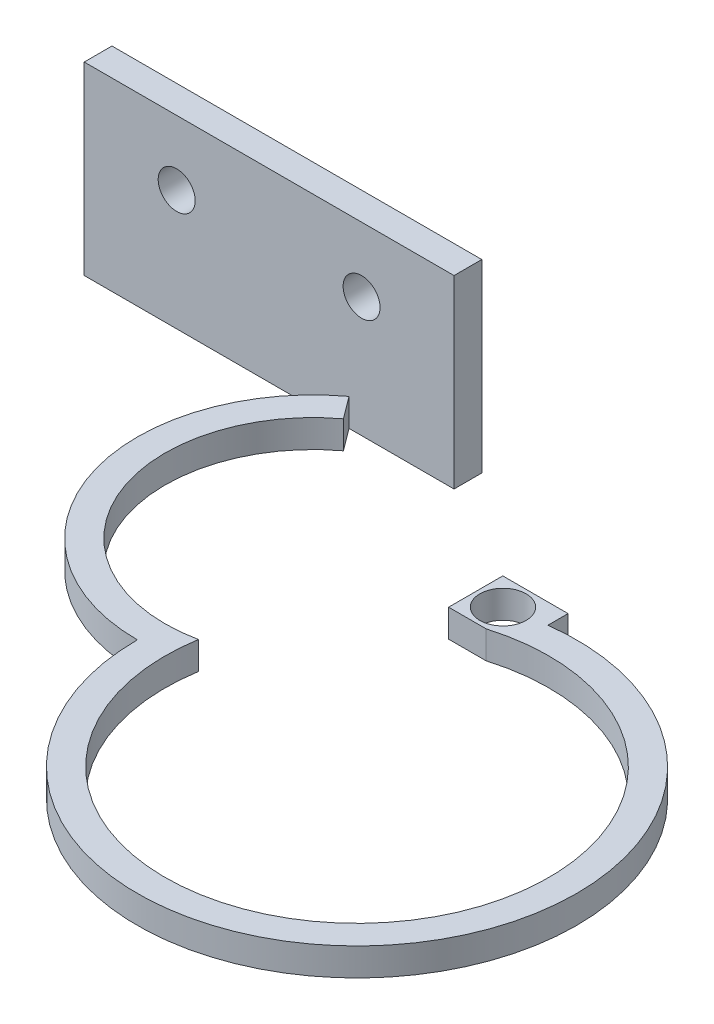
from build123d import *

# Parameters (mm, degrees)
SKIZZE1_W                       = 40
SKIZZE1_H                       = 20
SKIZZE1_R                       = 2
AUFSATZ_LINEAR_AUSTRAGEN1_DEPTH = 3
SKIZZE2_R                       = 2.5
AUFSATZ_LINEAR_AUSTRAGEN2_DEPTH = 3


with BuildPart() as part:
    # Skizze1 → Aufsatz-Linear austragen1 (new body)
    with BuildSketch(Plane.XY):
        with Locations((20, 10)):
            Rectangle(SKIZZE1_W, SKIZZE1_H)
        with Locations((10, 13)):
            Circle(SKIZZE1_R, mode=Mode.SUBTRACT)
        with Locations((30, 13)):
            Circle(SKIZZE1_R, mode=Mode.SUBTRACT)
    extrude(amount=AUFSATZ_LINEAR_AUSTRAGEN1_DEPTH)


with BuildPart() as body_2:
    # Skizze2 → Aufsatz-Linear austragen2 (new body)
    with BuildSketch(Plane.XZ):
        with BuildLine():
            Line((60.832427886, 13.676562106), (60.832427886, 11.5))
            Line((60.832427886, 11.5), (53.771624, 11.5))
            Line((53.771624, 11.5), (53.771624, 17.359476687))
            Line((53.771624, 17.359476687), (57.832427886, 17.359476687))
            ThreePointArc((57.832427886, 17.359476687), (79.344926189, 50.963088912), (43.27006525, 33.916249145))
            ThreePointArc((43.27006525, 33.916249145), (25.401600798, 24.815915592), (30.436247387, 5.405855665))
            Line((30.436247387, 5.405855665), (28.644081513, 3))
            ThreePointArc((28.644081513, 3), (21.956452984, 24.226367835), (40, 37.25378039))
            ThreePointArc((40, 37.25378039), (81.561847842, 52.984922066), (60.832427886, 13.676562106))
        make_face()
        with Locations(Location((56.706342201, 14.41333689, 0), (0, 0, 270))):
            Circle(SKIZZE2_R, mode=Mode.SUBTRACT)
    extrude(amount=-AUFSATZ_LINEAR_AUSTRAGEN2_DEPTH)


solid = Compound([part.part, body_2.part])
